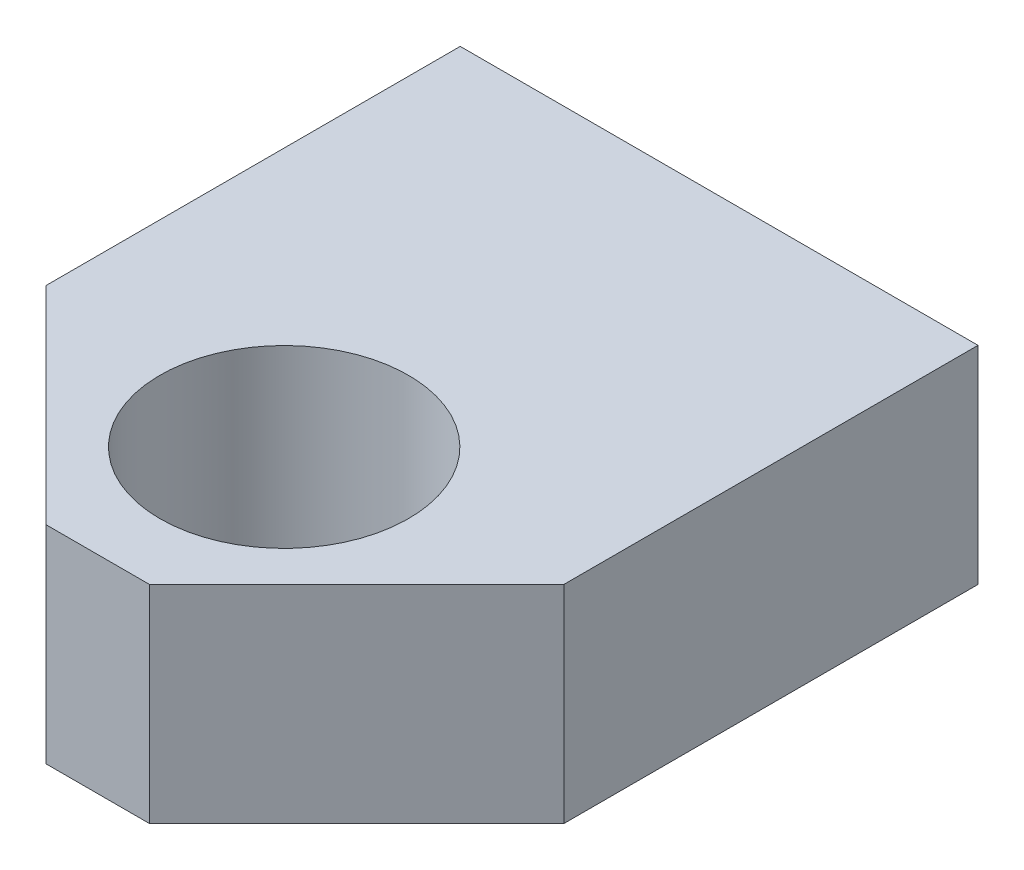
from build123d import *

# Parameters (mm, degrees)
ESQUISSE1_W             = 25
ESQUISSE1_H             = 10
BOSS_EXTRU_1_DEPTH      = 30
CHANFREIN1_SIZE         = 10
ESQUISSE2_R             = 6
ENL_V_MAT_EXTRU_1_DEPTH = 35.003676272


with BuildPart() as part:
    # Esquisse1 → Boss.-Extru.1 (new body)
    with BuildSketch(Plane.XY):
        with Locations((0, -5)):
            Rectangle(ESQUISSE1_W, ESQUISSE1_H)
    extrude(amount=BOSS_EXTRU_1_DEPTH)

    # Chanfrein1
    chanfrein1_edges = [part.edges().sort_by_distance(p)[0] for p in [
        (12.5, -5, 30),
        (-12.5, -5, 30),
    ]]
    chamfer(chanfrein1_edges, length=CHANFREIN1_SIZE)

    # Esquisse2 → Enl_v. mat.-Extru.1 (cut, through all)
    with BuildSketch(Plane(origin=(0, 0, 0), x_dir=(1, 0, 0), z_dir=(0, 1, 0))):
        with Locations(Location((0, -21, 0), (0, 0, 270))):
            Circle(ESQUISSE2_R)
    extrude(amount=-ENL_V_MAT_EXTRU_1_DEPTH, mode=Mode.SUBTRACT)


solid = part.part
